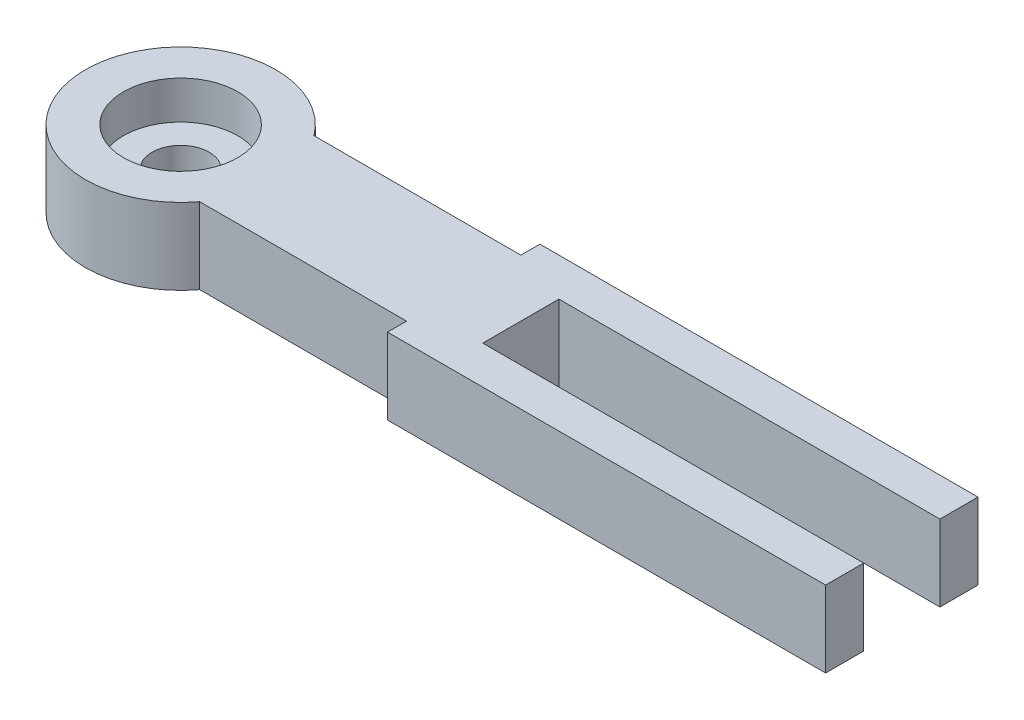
ISO-10303-21;
HEADER;
FILE_DESCRIPTION(('STEP AP214'),'2;1');
FILE_NAME('part.step','',(''),(''),'','','');
FILE_SCHEMA(('AUTOMOTIVE_DESIGN { 1 0 10303 214 1 1 1 1 }'));
ENDSEC;
DATA;
#1=APPLICATION_CONTEXT('core data for automotive mechanical design processes');
#2=APPLICATION_PROTOCOL_DEFINITION('international standard','automotive_design',2000,#1);
#3=PRODUCT_CONTEXT('',#1,'mechanical');
#4=PRODUCT('Part','Part','',(#3));
#5=PRODUCT_RELATED_PRODUCT_CATEGORY('part','',(#4));
#6=PRODUCT_DEFINITION_FORMATION('','',#4);
#7=PRODUCT_DEFINITION_CONTEXT('part definition',#1,'design');
#8=PRODUCT_DEFINITION('design','',#6,#7);
#9=PRODUCT_DEFINITION_SHAPE('','',#8);
#10=(LENGTH_UNIT() NAMED_UNIT(*) SI_UNIT(.MILLI.,.METRE.));
#11=(NAMED_UNIT(*) PLANE_ANGLE_UNIT() SI_UNIT($,.RADIAN.));
#12=(NAMED_UNIT(*) SI_UNIT($,.STERADIAN.) SOLID_ANGLE_UNIT());
#13=UNCERTAINTY_MEASURE_WITH_UNIT(LENGTH_MEASURE(1.E-05),#10,'distance_accuracy_value','');
#14=(GEOMETRIC_REPRESENTATION_CONTEXT(3) GLOBAL_UNCERTAINTY_ASSIGNED_CONTEXT((#13)) GLOBAL_UNIT_ASSIGNED_CONTEXT((#10,
#11,#12)) REPRESENTATION_CONTEXT('',''));
#15=CARTESIAN_POINT('',(0.,0.,0.));
#16=DIRECTION('',(0.,0.,1.));
#17=DIRECTION('',(1.,0.,0.));
#18=AXIS2_PLACEMENT_3D('',#15,#16,#17);
#19=CARTESIAN_POINT('',(24.2407664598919,4.,-7.19455252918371));
#20=DIRECTION('',(0.,-1.,0.));
#21=DIRECTION('',(0.,0.,-1.));
#22=AXIS2_PLACEMENT_3D('',#19,#20,#21);
#23=CYLINDRICAL_SURFACE('',#22,1.5);
#24=CARTESIAN_POINT('',(24.2407664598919,0.,-7.19455252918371));
#25=DIRECTION('',(0.,1.,0.));
#26=DIRECTION('',(0.,0.,1.));
#27=AXIS2_PLACEMENT_3D('',#24,#25,#26);
#28=CIRCLE('',#27,1.5);
#29=CARTESIAN_POINT('',(24.2407664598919,0.,-5.6945525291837));
#30=VERTEX_POINT('',#29);
#31=EDGE_CURVE('E203',#30,#30,#28,.T.);
#32=ORIENTED_EDGE('',*,*,#31,.F.);
#33=EDGE_LOOP('',(#32));
#34=FACE_BOUND('',#33,.T.);
#35=CARTESIAN_POINT('',(24.2407664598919,2.,-7.19455252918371));
#36=DIRECTION('',(0.,1.,0.));
#37=DIRECTION('',(0.,0.,1.));
#38=AXIS2_PLACEMENT_3D('',#35,#36,#37);
#39=CIRCLE('',#38,1.5);
#40=CARTESIAN_POINT('',(24.2407664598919,2.,-5.6945525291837));
#41=VERTEX_POINT('',#40);
#42=EDGE_CURVE('E330',#41,#41,#39,.T.);
#43=ORIENTED_EDGE('',*,*,#42,.T.);
#44=EDGE_LOOP('',(#43));
#45=FACE_BOUND('',#44,.T.);
#46=ADVANCED_FACE('F77',(#34,#45),#23,.F.);
#47=CARTESIAN_POINT('',(24.2407664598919,4.,-7.19455252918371));
#48=DIRECTION('',(0.,1.,0.));
#49=DIRECTION('',(0.,0.,1.));
#50=AXIS2_PLACEMENT_3D('',#47,#48,#49);
#51=PLANE('',#50);
#52=CARTESIAN_POINT('',(24.2407664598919,4.,-7.19455252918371));
#53=DIRECTION('',(0.,1.,0.));
#54=DIRECTION('',(0.,0.,1.));
#55=AXIS2_PLACEMENT_3D('',#52,#53,#54);
#56=CIRCLE('',#55,3.);
#57=CARTESIAN_POINT('',(24.2407664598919,4.,-4.1945525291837));
#58=VERTEX_POINT('',#57);
#59=EDGE_CURVE('E327',#58,#58,#56,.T.);
#60=ORIENTED_EDGE('',*,*,#59,.F.);
#61=EDGE_LOOP('',(#60));
#62=FACE_BOUND('',#61,.T.);
#63=CARTESIAN_POINT('',(24.2407664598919,4.,-7.19455252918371));
#64=DIRECTION('',(0.,1.,0.));
#65=DIRECTION('',(0.,0.,1.));
#66=AXIS2_PLACEMENT_3D('',#63,#64,#65);
#67=CIRCLE('',#66,5.);
#68=CARTESIAN_POINT('',(28.2407664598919,4.,-10.1945525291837));
#69=VERTEX_POINT('',#68);
#70=CARTESIAN_POINT('',(28.2407664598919,4.,-4.19455252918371));
#71=VERTEX_POINT('',#70);
#72=EDGE_CURVE('E230',#69,#71,#67,.T.);
#73=ORIENTED_EDGE('',*,*,#72,.T.);
#74=DIRECTION('',(1.,0.,0.));
#75=VECTOR('',#74,1.);
#76=CARTESIAN_POINT('',(28.2407664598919,4.,-4.19455252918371));
#77=LINE('',#76,#75);
#78=CARTESIAN_POINT('',(39.101167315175,4.,-4.19455252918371));
#79=VERTEX_POINT('',#78);
#80=EDGE_CURVE('E145',#71,#79,#77,.T.);
#81=ORIENTED_EDGE('',*,*,#80,.T.);
#82=DIRECTION('',(0.,0.,-1.));
#83=VECTOR('',#82,1.);
#84=CARTESIAN_POINT('',(39.101167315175,4.,-3.19455252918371));
#85=LINE('',#84,#83);
#86=CARTESIAN_POINT('',(39.101167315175,4.,-3.19455252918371));
#87=VERTEX_POINT('',#86);
#88=EDGE_CURVE('E253',#87,#79,#85,.T.);
#89=ORIENTED_EDGE('',*,*,#88,.F.);
#90=DIRECTION('',(1.,0.,0.));
#91=VECTOR('',#90,1.);
#92=CARTESIAN_POINT('',(39.101167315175,4.,-3.19455252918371));
#93=LINE('',#92,#91);
#94=CARTESIAN_POINT('',(62.1011673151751,4.,-3.19455252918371));
#95=VERTEX_POINT('',#94);
#96=EDGE_CURVE('E273',#87,#95,#93,.T.);
#97=ORIENTED_EDGE('',*,*,#96,.T.);
#98=DIRECTION('',(0.,0.,-1.));
#99=VECTOR('',#98,1.);
#100=CARTESIAN_POINT('',(62.1011673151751,4.,-3.19455252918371));
#101=LINE('',#100,#99);
#102=CARTESIAN_POINT('',(62.1011673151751,4.,-5.19455252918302));
#103=VERTEX_POINT('',#102);
#104=EDGE_CURVE('E269',#95,#103,#101,.T.);
#105=ORIENTED_EDGE('',*,*,#104,.T.);
#106=DIRECTION('',(1.,0.,0.));
#107=VECTOR('',#106,1.);
#108=CARTESIAN_POINT('',(42.1011673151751,4.,-5.19455252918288));
#109=LINE('',#108,#107);
#110=CARTESIAN_POINT('',(42.1011673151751,4.,-5.19455252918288));
#111=VERTEX_POINT('',#110);
#112=EDGE_CURVE('E272',#111,#103,#109,.T.);
#113=ORIENTED_EDGE('',*,*,#112,.F.);
#114=DIRECTION('',(0.,0.,-1.));
#115=VECTOR('',#114,1.);
#116=CARTESIAN_POINT('',(42.1011673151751,4.,-5.19455252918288));
#117=LINE('',#116,#115);
#118=CARTESIAN_POINT('',(42.1011673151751,4.,-9.19455252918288));
#119=VERTEX_POINT('',#118);
#120=EDGE_CURVE('E275',#111,#119,#117,.T.);
#121=ORIENTED_EDGE('',*,*,#120,.T.);
#122=DIRECTION('',(1.,0.,0.));
#123=VECTOR('',#122,1.);
#124=CARTESIAN_POINT('',(42.1011673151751,4.,-9.19455252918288));
#125=LINE('',#124,#123);
#126=CARTESIAN_POINT('',(62.1011673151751,4.,-9.19455252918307));
#127=VERTEX_POINT('',#126);
#128=EDGE_CURVE('E195',#119,#127,#125,.T.);
#129=ORIENTED_EDGE('',*,*,#128,.T.);
#130=DIRECTION('',(0.,0.,1.));
#131=VECTOR('',#130,1.);
#132=CARTESIAN_POINT('',(62.1011673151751,4.,-10.1945525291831));
#133=LINE('',#132,#131);
#134=CARTESIAN_POINT('',(62.1011673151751,4.,-11.1945525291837));
#135=VERTEX_POINT('',#134);
#136=EDGE_CURVE('E192',#135,#127,#133,.T.);
#137=ORIENTED_EDGE('',*,*,#136,.F.);
#138=DIRECTION('',(1.,0.,0.));
#139=VECTOR('',#138,1.);
#140=CARTESIAN_POINT('',(39.101167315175,4.,-11.1945525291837));
#141=LINE('',#140,#139);
#142=CARTESIAN_POINT('',(39.101167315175,4.,-11.1945525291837));
#143=VERTEX_POINT('',#142);
#144=EDGE_CURVE('E177',#143,#135,#141,.T.);
#145=ORIENTED_EDGE('',*,*,#144,.F.);
#146=DIRECTION('',(0.,0.,1.));
#147=VECTOR('',#146,1.);
#148=CARTESIAN_POINT('',(39.101167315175,4.,-11.1945525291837));
#149=LINE('',#148,#147);
#150=CARTESIAN_POINT('',(39.101167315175,4.,-10.1945525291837));
#151=VERTEX_POINT('',#150);
#152=EDGE_CURVE('E184',#143,#151,#149,.T.);
#153=ORIENTED_EDGE('',*,*,#152,.T.);
#154=DIRECTION('',(1.,0.,0.));
#155=VECTOR('',#154,1.);
#156=CARTESIAN_POINT('',(28.2407664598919,4.,-10.1945525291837));
#157=LINE('',#156,#155);
#158=EDGE_CURVE('E188',#69,#151,#157,.T.);
#159=ORIENTED_EDGE('',*,*,#158,.F.);
#160=EDGE_LOOP('',(#73,#81,#89,#97,#105,#113,#121,#129,#137,#145,#153,#159));
#161=FACE_BOUND('',#160,.T.);
#162=ADVANCED_FACE('F190',(#62,#161),#51,.T.);
#163=CARTESIAN_POINT('',(24.2407664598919,0.,-7.19455252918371));
#164=DIRECTION('',(0.,1.,0.));
#165=DIRECTION('',(0.,0.,1.));
#166=AXIS2_PLACEMENT_3D('',#163,#164,#165);
#167=PLANE('',#166);
#168=CARTESIAN_POINT('',(24.2407664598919,0.,-7.19455252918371));
#169=DIRECTION('',(0.,1.,0.));
#170=DIRECTION('',(0.,0.,1.));
#171=AXIS2_PLACEMENT_3D('',#168,#169,#170);
#172=CIRCLE('',#171,5.);
#173=CARTESIAN_POINT('',(28.2407664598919,0.,-10.1945525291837));
#174=VERTEX_POINT('',#173);
#175=CARTESIAN_POINT('',(28.2407664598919,0.,-4.19455252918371));
#176=VERTEX_POINT('',#175);
#177=EDGE_CURVE('E200',#174,#176,#172,.T.);
#178=ORIENTED_EDGE('',*,*,#177,.F.);
#179=DIRECTION('',(1.,0.,0.));
#180=VECTOR('',#179,1.);
#181=CARTESIAN_POINT('',(28.2407664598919,0.,-10.1945525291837));
#182=LINE('',#181,#180);
#183=CARTESIAN_POINT('',(39.101167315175,0.,-10.1945525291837));
#184=VERTEX_POINT('',#183);
#185=EDGE_CURVE('E227',#174,#184,#182,.T.);
#186=ORIENTED_EDGE('',*,*,#185,.T.);
#187=DIRECTION('',(0.,0.,1.));
#188=VECTOR('',#187,1.);
#189=CARTESIAN_POINT('',(39.101167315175,0.,-11.1945525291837));
#190=LINE('',#189,#188);
#191=CARTESIAN_POINT('',(39.101167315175,0.,-11.1945525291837));
#192=VERTEX_POINT('',#191);
#193=EDGE_CURVE('E225',#192,#184,#190,.T.);
#194=ORIENTED_EDGE('',*,*,#193,.F.);
#195=DIRECTION('',(1.,0.,0.));
#196=VECTOR('',#195,1.);
#197=CARTESIAN_POINT('',(39.101167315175,0.,-11.1945525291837));
#198=LINE('',#197,#196);
#199=CARTESIAN_POINT('',(62.1011673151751,0.,-11.1945525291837));
#200=VERTEX_POINT('',#199);
#201=EDGE_CURVE('E179',#192,#200,#198,.T.);
#202=ORIENTED_EDGE('',*,*,#201,.T.);
#203=DIRECTION('',(0.,0.,1.));
#204=VECTOR('',#203,1.);
#205=CARTESIAN_POINT('',(62.1011673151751,0.,-11.1945525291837));
#206=LINE('',#205,#204);
#207=CARTESIAN_POINT('',(62.1011673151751,0.,-9.19455252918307));
#208=VERTEX_POINT('',#207);
#209=EDGE_CURVE('E222',#200,#208,#206,.T.);
#210=ORIENTED_EDGE('',*,*,#209,.T.);
#211=DIRECTION('',(1.,0.,0.));
#212=VECTOR('',#211,1.);
#213=CARTESIAN_POINT('',(42.1011673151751,0.,-9.19455252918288));
#214=LINE('',#213,#212);
#215=CARTESIAN_POINT('',(42.1011673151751,0.,-9.19455252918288));
#216=VERTEX_POINT('',#215);
#217=EDGE_CURVE('E219',#216,#208,#214,.T.);
#218=ORIENTED_EDGE('',*,*,#217,.F.);
#219=DIRECTION('',(0.,0.,-1.));
#220=VECTOR('',#219,1.);
#221=CARTESIAN_POINT('',(42.1011673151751,0.,-5.19455252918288));
#222=LINE('',#221,#220);
#223=CARTESIAN_POINT('',(42.1011673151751,0.,-5.19455252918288));
#224=VERTEX_POINT('',#223);
#225=EDGE_CURVE('E217',#224,#216,#222,.T.);
#226=ORIENTED_EDGE('',*,*,#225,.F.);
#227=DIRECTION('',(1.,0.,0.));
#228=VECTOR('',#227,1.);
#229=CARTESIAN_POINT('',(42.1011673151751,0.,-5.19455252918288));
#230=LINE('',#229,#228);
#231=CARTESIAN_POINT('',(62.1011673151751,0.,-5.19455252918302));
#232=VERTEX_POINT('',#231);
#233=EDGE_CURVE('E214',#224,#232,#230,.T.);
#234=ORIENTED_EDGE('',*,*,#233,.T.);
#235=DIRECTION('',(0.,0.,1.));
#236=VECTOR('',#235,1.);
#237=CARTESIAN_POINT('',(62.1011673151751,0.,-5.19455252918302));
#238=LINE('',#237,#236);
#239=CARTESIAN_POINT('',(62.1011673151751,0.,-3.19455252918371));
#240=VERTEX_POINT('',#239);
#241=EDGE_CURVE('E212',#232,#240,#238,.T.);
#242=ORIENTED_EDGE('',*,*,#241,.T.);
#243=DIRECTION('',(1.,0.,0.));
#244=VECTOR('',#243,1.);
#245=CARTESIAN_POINT('',(39.101167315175,0.,-3.19455252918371));
#246=LINE('',#245,#244);
#247=CARTESIAN_POINT('',(39.101167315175,0.,-3.19455252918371));
#248=VERTEX_POINT('',#247);
#249=EDGE_CURVE('E209',#248,#240,#246,.T.);
#250=ORIENTED_EDGE('',*,*,#249,.F.);
#251=DIRECTION('',(0.,0.,-1.));
#252=VECTOR('',#251,1.);
#253=CARTESIAN_POINT('',(39.101167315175,0.,-3.19455252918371));
#254=LINE('',#253,#252);
#255=CARTESIAN_POINT('',(39.101167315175,0.,-4.19455252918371));
#256=VERTEX_POINT('',#255);
#257=EDGE_CURVE('E206',#248,#256,#254,.T.);
#258=ORIENTED_EDGE('',*,*,#257,.T.);
#259=DIRECTION('',(1.,0.,0.));
#260=VECTOR('',#259,1.);
#261=CARTESIAN_POINT('',(28.2407664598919,0.,-4.19455252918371));
#262=LINE('',#261,#260);
#263=EDGE_CURVE('E202',#176,#256,#262,.T.);
#264=ORIENTED_EDGE('',*,*,#263,.F.);
#265=EDGE_LOOP('',(#178,#186,#194,#202,#210,#218,#226,#234,#242,#250,#258,#264));
#266=FACE_BOUND('',#265,.T.);
#267=ORIENTED_EDGE('',*,*,#31,.T.);
#268=EDGE_LOOP('',(#267));
#269=FACE_BOUND('',#268,.T.);
#270=ADVANCED_FACE('F258',(#266,#269),#167,.F.);
#271=CARTESIAN_POINT('',(24.2407664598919,4.,-7.19455252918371));
#272=DIRECTION('',(0.,-1.,0.));
#273=DIRECTION('',(0.,0.,-1.));
#274=AXIS2_PLACEMENT_3D('',#271,#272,#273);
#275=CYLINDRICAL_SURFACE('',#274,5.);
#276=ORIENTED_EDGE('',*,*,#177,.T.);
#277=DIRECTION('',(0.,-1.,0.));
#278=VECTOR('',#277,1.);
#279=CARTESIAN_POINT('',(28.2407664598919,4.,-4.19455252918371));
#280=LINE('',#279,#278);
#281=EDGE_CURVE('E12',#71,#176,#280,.T.);
#282=ORIENTED_EDGE('',*,*,#281,.F.);
#283=ORIENTED_EDGE('',*,*,#72,.F.);
#284=DIRECTION('',(0.,-1.,0.));
#285=VECTOR('',#284,1.);
#286=CARTESIAN_POINT('',(28.2407664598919,4.,-10.1945525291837));
#287=LINE('',#286,#285);
#288=EDGE_CURVE('E94',#69,#174,#287,.T.);
#289=ORIENTED_EDGE('',*,*,#288,.T.);
#290=EDGE_LOOP('',(#276,#282,#283,#289));
#291=FACE_BOUND('',#290,.T.);
#292=ADVANCED_FACE('F79',(#291),#275,.T.);
#293=CARTESIAN_POINT('',(28.2407664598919,4.,-4.19455252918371));
#294=DIRECTION('',(0.,0.,-1.));
#295=DIRECTION('',(-1.,0.,0.));
#296=AXIS2_PLACEMENT_3D('',#293,#294,#295);
#297=PLANE('',#296);
#298=ORIENTED_EDGE('',*,*,#263,.T.);
#299=DIRECTION('',(0.,-1.,0.));
#300=VECTOR('',#299,1.);
#301=CARTESIAN_POINT('',(39.101167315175,4.,-4.19455252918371));
#302=LINE('',#301,#300);
#303=EDGE_CURVE('E86',#79,#256,#302,.T.);
#304=ORIENTED_EDGE('',*,*,#303,.F.);
#305=ORIENTED_EDGE('',*,*,#80,.F.);
#306=ORIENTED_EDGE('',*,*,#281,.T.);
#307=EDGE_LOOP('',(#298,#304,#305,#306));
#308=FACE_BOUND('',#307,.T.);
#309=ADVANCED_FACE('F254',(#308),#297,.F.);
#310=CARTESIAN_POINT('',(39.101167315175,4.,-3.19455252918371));
#311=DIRECTION('',(-1.,0.,0.));
#312=DIRECTION('',(0.,0.,1.));
#313=AXIS2_PLACEMENT_3D('',#310,#311,#312);
#314=PLANE('',#313);
#315=ORIENTED_EDGE('',*,*,#257,.F.);
#316=DIRECTION('',(0.,-1.,0.));
#317=VECTOR('',#316,1.);
#318=CARTESIAN_POINT('',(39.101167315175,4.,-3.19455252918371));
#319=LINE('',#318,#317);
#320=EDGE_CURVE('E247',#87,#248,#319,.T.);
#321=ORIENTED_EDGE('',*,*,#320,.F.);
#322=ORIENTED_EDGE('',*,*,#88,.T.);
#323=ORIENTED_EDGE('',*,*,#303,.T.);
#324=EDGE_LOOP('',(#315,#321,#322,#323));
#325=FACE_BOUND('',#324,.T.);
#326=ADVANCED_FACE('F251',(#325),#314,.T.);
#327=CARTESIAN_POINT('',(39.101167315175,4.,-3.19455252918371));
#328=DIRECTION('',(0.,0.,-1.));
#329=DIRECTION('',(-1.,0.,0.));
#330=AXIS2_PLACEMENT_3D('',#327,#328,#329);
#331=PLANE('',#330);
#332=ORIENTED_EDGE('',*,*,#249,.T.);
#333=DIRECTION('',(0.,-1.,0.));
#334=VECTOR('',#333,1.);
#335=CARTESIAN_POINT('',(62.1011673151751,4.,-3.19455252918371));
#336=LINE('',#335,#334);
#337=EDGE_CURVE('E244',#95,#240,#336,.T.);
#338=ORIENTED_EDGE('',*,*,#337,.F.);
#339=ORIENTED_EDGE('',*,*,#96,.F.);
#340=ORIENTED_EDGE('',*,*,#320,.T.);
#341=EDGE_LOOP('',(#332,#338,#339,#340));
#342=FACE_BOUND('',#341,.T.);
#343=ADVANCED_FACE('F263',(#342),#331,.F.);
#344=CARTESIAN_POINT('',(62.1011673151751,4.,-5.19455252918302));
#345=DIRECTION('',(1.,0.,0.));
#346=DIRECTION('',(0.,0.,-1.));
#347=AXIS2_PLACEMENT_3D('',#344,#345,#346);
#348=PLANE('',#347);
#349=ORIENTED_EDGE('',*,*,#241,.F.);
#350=DIRECTION('',(0.,-1.,0.));
#351=VECTOR('',#350,1.);
#352=CARTESIAN_POINT('',(62.1011673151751,4.,-5.19455252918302));
#353=LINE('',#352,#351);
#354=EDGE_CURVE('E242',#103,#232,#353,.T.);
#355=ORIENTED_EDGE('',*,*,#354,.F.);
#356=ORIENTED_EDGE('',*,*,#104,.F.);
#357=ORIENTED_EDGE('',*,*,#337,.T.);
#358=EDGE_LOOP('',(#349,#355,#356,#357));
#359=FACE_BOUND('',#358,.T.);
#360=ADVANCED_FACE('F267',(#359),#348,.T.);
#361=CARTESIAN_POINT('',(42.1011673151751,4.,-5.19455252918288));
#362=DIRECTION('',(0.,0.,-1.));
#363=DIRECTION('',(-1.,0.,0.));
#364=AXIS2_PLACEMENT_3D('',#361,#362,#363);
#365=PLANE('',#364);
#366=ORIENTED_EDGE('',*,*,#233,.F.);
#367=DIRECTION('',(0.,-1.,0.));
#368=VECTOR('',#367,1.);
#369=CARTESIAN_POINT('',(42.1011673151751,4.,-5.19455252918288));
#370=LINE('',#369,#368);
#371=EDGE_CURVE('E240',#111,#224,#370,.T.);
#372=ORIENTED_EDGE('',*,*,#371,.F.);
#373=ORIENTED_EDGE('',*,*,#112,.T.);
#374=ORIENTED_EDGE('',*,*,#354,.T.);
#375=EDGE_LOOP('',(#366,#372,#373,#374));
#376=FACE_BOUND('',#375,.T.);
#377=ADVANCED_FACE('F403',(#376),#365,.T.);
#378=CARTESIAN_POINT('',(42.1011673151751,4.,-5.19455252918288));
#379=DIRECTION('',(-1.,0.,0.));
#380=DIRECTION('',(0.,0.,1.));
#381=AXIS2_PLACEMENT_3D('',#378,#379,#380);
#382=PLANE('',#381);
#383=ORIENTED_EDGE('',*,*,#225,.T.);
#384=DIRECTION('',(0.,-1.,0.));
#385=VECTOR('',#384,1.);
#386=CARTESIAN_POINT('',(42.1011673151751,4.,-9.19455252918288));
#387=LINE('',#386,#385);
#388=EDGE_CURVE('E237',#119,#216,#387,.T.);
#389=ORIENTED_EDGE('',*,*,#388,.F.);
#390=ORIENTED_EDGE('',*,*,#120,.F.);
#391=ORIENTED_EDGE('',*,*,#371,.T.);
#392=EDGE_LOOP('',(#383,#389,#390,#391));
#393=FACE_BOUND('',#392,.T.);
#394=ADVANCED_FACE('F394',(#393),#382,.F.);
#395=CARTESIAN_POINT('',(42.1011673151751,4.,-9.19455252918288));
#396=DIRECTION('',(0.,0.,-1.));
#397=DIRECTION('',(-1.,0.,0.));
#398=AXIS2_PLACEMENT_3D('',#395,#396,#397);
#399=PLANE('',#398);
#400=ORIENTED_EDGE('',*,*,#217,.T.);
#401=DIRECTION('',(0.,-1.,0.));
#402=VECTOR('',#401,1.);
#403=CARTESIAN_POINT('',(62.1011673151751,4.,-9.19455252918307));
#404=LINE('',#403,#402);
#405=EDGE_CURVE('E234',#127,#208,#404,.T.);
#406=ORIENTED_EDGE('',*,*,#405,.F.);
#407=ORIENTED_EDGE('',*,*,#128,.F.);
#408=ORIENTED_EDGE('',*,*,#388,.T.);
#409=EDGE_LOOP('',(#400,#406,#407,#408));
#410=FACE_BOUND('',#409,.T.);
#411=ADVANCED_FACE('F285',(#410),#399,.F.);
#412=CARTESIAN_POINT('',(62.1011673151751,4.,-11.1945525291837));
#413=DIRECTION('',(1.,0.,0.));
#414=DIRECTION('',(0.,0.,-1.));
#415=AXIS2_PLACEMENT_3D('',#412,#413,#414);
#416=PLANE('',#415);
#417=ORIENTED_EDGE('',*,*,#209,.F.);
#418=DIRECTION('',(0.,-1.,0.));
#419=VECTOR('',#418,1.);
#420=CARTESIAN_POINT('',(62.1011673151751,4.,-11.1945525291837));
#421=LINE('',#420,#419);
#422=EDGE_CURVE('E182',#135,#200,#421,.T.);
#423=ORIENTED_EDGE('',*,*,#422,.F.);
#424=ORIENTED_EDGE('',*,*,#136,.T.);
#425=ORIENTED_EDGE('',*,*,#405,.T.);
#426=EDGE_LOOP('',(#417,#423,#424,#425));
#427=FACE_BOUND('',#426,.T.);
#428=ADVANCED_FACE('F289',(#427),#416,.T.);
#429=CARTESIAN_POINT('',(39.101167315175,4.,-11.1945525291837));
#430=DIRECTION('',(0.,0.,-1.));
#431=DIRECTION('',(-1.,0.,0.));
#432=AXIS2_PLACEMENT_3D('',#429,#430,#431);
#433=PLANE('',#432);
#434=ORIENTED_EDGE('',*,*,#201,.F.);
#435=DIRECTION('',(0.,-1.,0.));
#436=VECTOR('',#435,1.);
#437=CARTESIAN_POINT('',(39.101167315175,4.,-11.1945525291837));
#438=LINE('',#437,#436);
#439=EDGE_CURVE('E173',#143,#192,#438,.T.);
#440=ORIENTED_EDGE('',*,*,#439,.F.);
#441=ORIENTED_EDGE('',*,*,#144,.T.);
#442=ORIENTED_EDGE('',*,*,#422,.T.);
#443=EDGE_LOOP('',(#434,#440,#441,#442));
#444=FACE_BOUND('',#443,.T.);
#445=ADVANCED_FACE('F175',(#444),#433,.T.);
#446=CARTESIAN_POINT('',(39.101167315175,4.,-11.1945525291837));
#447=DIRECTION('',(1.,0.,0.));
#448=DIRECTION('',(0.,0.,-1.));
#449=AXIS2_PLACEMENT_3D('',#446,#447,#448);
#450=PLANE('',#449);
#451=ORIENTED_EDGE('',*,*,#193,.T.);
#452=DIRECTION('',(0.,-1.,0.));
#453=VECTOR('',#452,1.);
#454=CARTESIAN_POINT('',(39.101167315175,4.,-10.1945525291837));
#455=LINE('',#454,#453);
#456=EDGE_CURVE('E133',#151,#184,#455,.T.);
#457=ORIENTED_EDGE('',*,*,#456,.F.);
#458=ORIENTED_EDGE('',*,*,#152,.F.);
#459=ORIENTED_EDGE('',*,*,#439,.T.);
#460=EDGE_LOOP('',(#451,#457,#458,#459));
#461=FACE_BOUND('',#460,.T.);
#462=ADVANCED_FACE('F185',(#461),#450,.F.);
#463=CARTESIAN_POINT('',(28.2407664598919,4.,-10.1945525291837));
#464=DIRECTION('',(0.,0.,-1.));
#465=DIRECTION('',(-1.,0.,0.));
#466=AXIS2_PLACEMENT_3D('',#463,#464,#465);
#467=PLANE('',#466);
#468=ORIENTED_EDGE('',*,*,#185,.F.);
#469=ORIENTED_EDGE('',*,*,#288,.F.);
#470=ORIENTED_EDGE('',*,*,#158,.T.);
#471=ORIENTED_EDGE('',*,*,#456,.T.);
#472=EDGE_LOOP('',(#468,#469,#470,#471));
#473=FACE_BOUND('',#472,.T.);
#474=ADVANCED_FACE('F290',(#473),#467,.T.);
#475=CARTESIAN_POINT('',(24.2407664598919,2.,-7.19455252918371));
#476=DIRECTION('',(0.,1.,0.));
#477=DIRECTION('',(0.,0.,1.));
#478=AXIS2_PLACEMENT_3D('',#475,#476,#477);
#479=CYLINDRICAL_SURFACE('',#478,3.);
#480=CARTESIAN_POINT('',(24.2407664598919,2.,-7.19455252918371));
#481=DIRECTION('',(0.,1.,0.));
#482=DIRECTION('',(0.,0.,1.));
#483=AXIS2_PLACEMENT_3D('',#480,#481,#482);
#484=CIRCLE('',#483,3.);
#485=CARTESIAN_POINT('',(24.2407664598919,2.,-4.1945525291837));
#486=VERTEX_POINT('',#485);
#487=EDGE_CURVE('E326',#486,#486,#484,.T.);
#488=ORIENTED_EDGE('',*,*,#487,.F.);
#489=EDGE_LOOP('',(#488));
#490=FACE_BOUND('',#489,.T.);
#491=ORIENTED_EDGE('',*,*,#59,.T.);
#492=EDGE_LOOP('',(#491));
#493=FACE_BOUND('',#492,.T.);
#494=ADVANCED_FACE('F292',(#490,#493),#479,.F.);
#495=CARTESIAN_POINT('',(24.2407664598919,2.,-7.19455252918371));
#496=DIRECTION('',(0.,1.,0.));
#497=DIRECTION('',(0.,0.,1.));
#498=AXIS2_PLACEMENT_3D('',#495,#496,#497);
#499=PLANE('',#498);
#500=ORIENTED_EDGE('',*,*,#42,.F.);
#501=EDGE_LOOP('',(#500));
#502=FACE_BOUND('',#501,.T.);
#503=ORIENTED_EDGE('',*,*,#487,.T.);
#504=EDGE_LOOP('',(#503));
#505=FACE_BOUND('',#504,.T.);
#506=ADVANCED_FACE('F298',(#502,#505),#499,.T.);
#507=CLOSED_SHELL('',(#46,#162,#270,#292,#309,#326,#343,#360,#377,#394,#411,#428,#445,#462,#474,
#494,#506));
#508=MANIFOLD_SOLID_BREP('B2',#507);
#509=ADVANCED_BREP_SHAPE_REPRESENTATION('',(#18,#508),#14);
#510=SHAPE_DEFINITION_REPRESENTATION(#9,#509);
ENDSEC;
END-ISO-10303-21;
